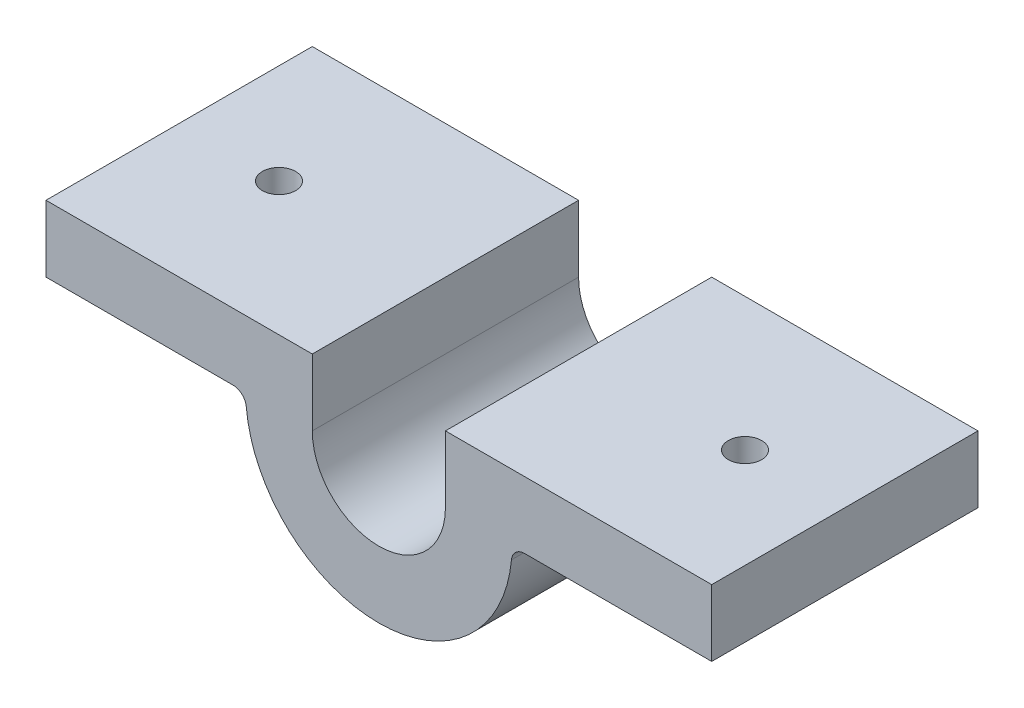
from build123d import *

# Parameters (mm, degrees)
BOSS_EXTRUDE1_DEPTH = 20
SKETCH2_R           = 1.25
CUT_EXTRUDE1_DEPTH  = 20
FILLET1_R           = 1


with BuildPart() as part:
    # Sketch1 → Boss-Extrude1 (new body)
    with BuildSketch(Plane.XY):
        with BuildLine():
            Line((-25, 5), (-5, 5))
            Line((-5, 5), (-5, 0))
            ThreePointArc((-5, 0), (0, -5), (5, 0))
            Line((5, 0), (5, 5))
            Line((5, 5), (25, 5))
            Line((25, 5), (25, 0))
            Line((25, 0), (10, 0))
            ThreePointArc((10, 0), (0, -10), (-10, 0))
            Line((-10, 0), (-25, 0))
            Line((-25, 0), (-25, 5))
        make_face()
    extrude(amount=-BOSS_EXTRUDE1_DEPTH)

    # Sketch2 → Cut-Extrude1 (cut)
    with BuildSketch(Plane(origin=(0, 0, 0), x_dir=(-1, 0, 0), z_dir=(0, -1, 0))):
        with Locations(Location((17.5, 10, 0), (0, 0, 90))):
            Circle(SKETCH2_R)
        with Locations(Location((-17.5, 10, 0), (0, 0, 90))):
            Circle(SKETCH2_R)
    extrude(amount=-CUT_EXTRUDE1_DEPTH, mode=Mode.SUBTRACT)

    # Fillet1
    fillet1_edges = [part.edges().sort_by_distance(p)[0] for p in [
        (10, 0, -10),
        (-10, 0, -10),
    ]]
    fillet(fillet1_edges, radius=FILLET1_R)


solid = part.part
